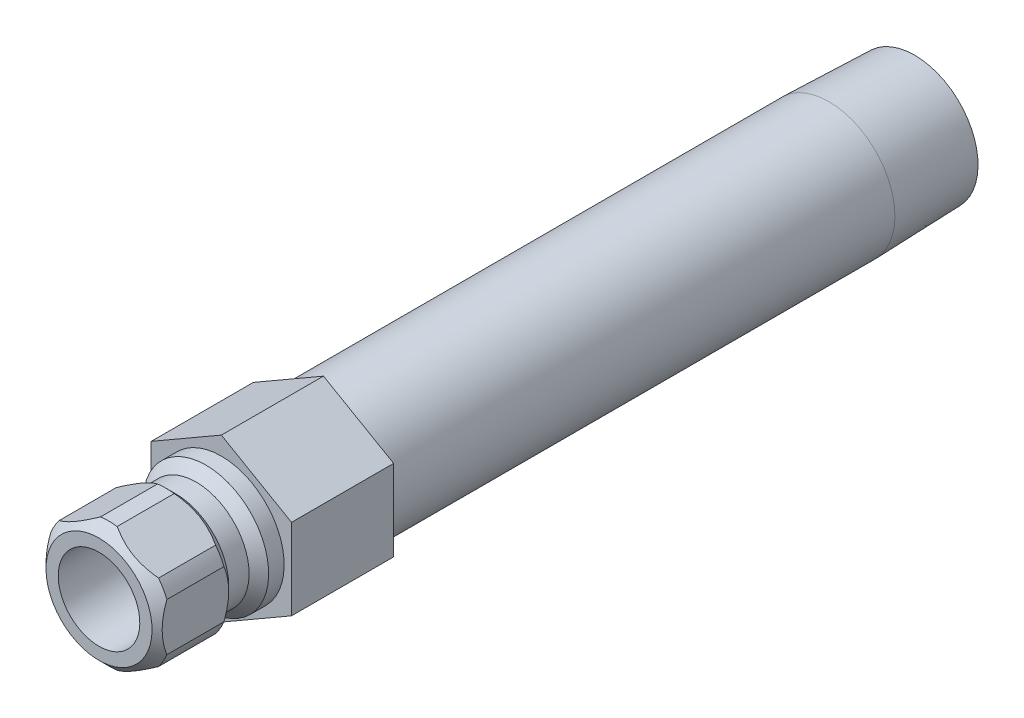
from build123d import *

# Parameters (mm, degrees)
SKETCH2_R           = 2.38125
BOSS_EXTRUDE1_DEPTH = 7.9502
CUT_EXTRUDE1_START  = 3.556
SKETCH3_OUTSIDE_W   = 26.054
SKETCH3_OUTSIDE_H   = 27.744
CUT_EXTRUDE1_DEPTH  = 52.059808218


with BuildPart() as part:
    # Sketch1 → Revolve1 (revolve)
    with BuildSketch(Plane(origin=(0, 0, 0), x_dir=(0, 0, -1), z_dir=(1, 0, 0))):
        Polygon((-9.525, 3.175), (-9.525, 4.1275), (-8.763, 4.8895), (-4.318, 4.8895), (-3.556, 4.1275), (-1.9685, 4.1275), (-1.2065, 4.8895), (0, 4.8895), (0, 5.1435), (47.2948, 5.1435), (53.975, 4.934744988), (53.975, 2.38125), (0.127, 2.38125), (0.127, 3.175), align=None)
    revolve(axis=Axis((0, 0, 0), (0, 0, 1)))

    # Sketch2 → Boss-Extrude1 (add)
    with BuildSketch(Plane.XY):
        Polygon((-5.461, 3.15290982), (-5.461, -3.15290982), (0, -6.30581964), (5.461, -3.15290982), (5.461, 3.15290982), (0, 6.30581964), align=None)
        with Locations(Location((0, 0, 0), (0, 0, 90))):
            Circle(SKETCH2_R, mode=Mode.SUBTRACT)
    extrude(amount=-BOSS_EXTRUDE1_DEPTH)

    # Sketch3 outside → Cut-Extrude1 (cut, through all)
    with BuildSketch(Plane.XY.offset(CUT_EXTRUDE1_START)):
        Rectangle(SKETCH3_OUTSIDE_W, SKETCH3_OUTSIDE_H)
        Polygon((-4.5212, -2.610316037), (0, -5.220632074), (4.5212, -2.610316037), (4.5212, 2.610316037), (0, 5.220632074), (-4.5212, 2.610316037), align=None, mode=Mode.SUBTRACT)
    extrude(amount=CUT_EXTRUDE1_DEPTH, mode=Mode.SUBTRACT)


solid = part.part
